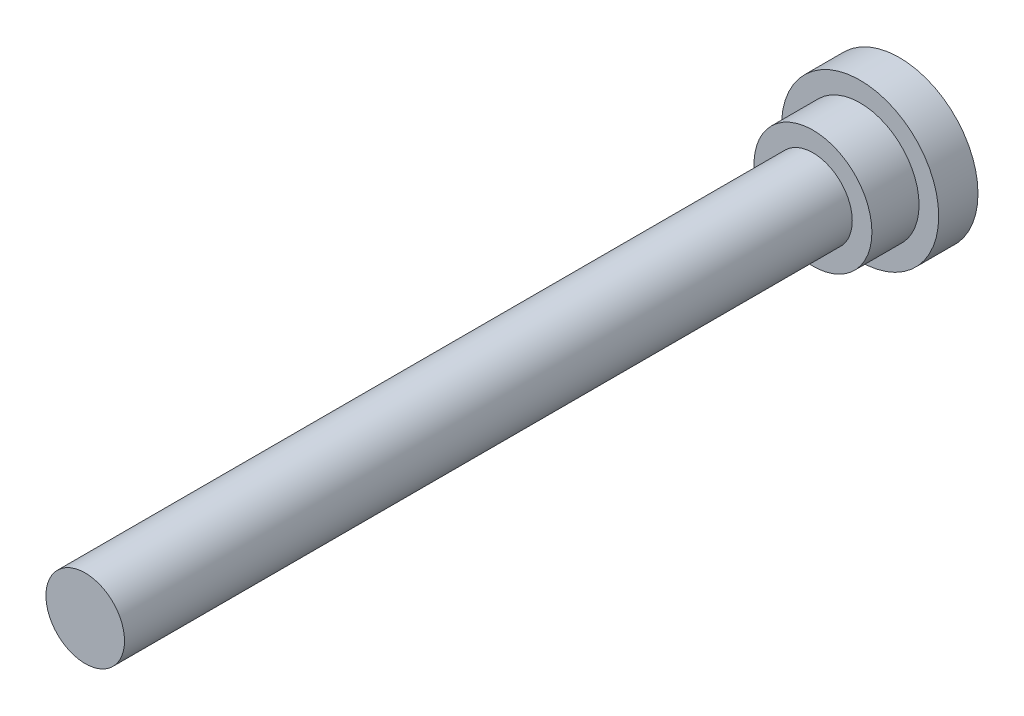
ISO-10303-21;
HEADER;
FILE_DESCRIPTION(('STEP AP214'),'2;1');
FILE_NAME('part.step','',(''),(''),'','','');
FILE_SCHEMA(('AUTOMOTIVE_DESIGN { 1 0 10303 214 1 1 1 1 }'));
ENDSEC;
DATA;
#1=APPLICATION_CONTEXT('core data for automotive mechanical design processes');
#2=APPLICATION_PROTOCOL_DEFINITION('international standard','automotive_design',2000,#1);
#3=PRODUCT_CONTEXT('',#1,'mechanical');
#4=PRODUCT('Part','Part','',(#3));
#5=PRODUCT_RELATED_PRODUCT_CATEGORY('part','',(#4));
#6=PRODUCT_DEFINITION_FORMATION('','',#4);
#7=PRODUCT_DEFINITION_CONTEXT('part definition',#1,'design');
#8=PRODUCT_DEFINITION('design','',#6,#7);
#9=PRODUCT_DEFINITION_SHAPE('','',#8);
#10=(LENGTH_UNIT() NAMED_UNIT(*) SI_UNIT(.MILLI.,.METRE.));
#11=(NAMED_UNIT(*) PLANE_ANGLE_UNIT() SI_UNIT($,.RADIAN.));
#12=(NAMED_UNIT(*) SI_UNIT($,.STERADIAN.) SOLID_ANGLE_UNIT());
#13=UNCERTAINTY_MEASURE_WITH_UNIT(LENGTH_MEASURE(1.E-05),#10,'distance_accuracy_value','');
#14=(GEOMETRIC_REPRESENTATION_CONTEXT(3) GLOBAL_UNCERTAINTY_ASSIGNED_CONTEXT((#13)) GLOBAL_UNIT_ASSIGNED_CONTEXT((#10,
#11,#12)) REPRESENTATION_CONTEXT('',''));
#15=CARTESIAN_POINT('',(0.,0.,0.));
#16=DIRECTION('',(0.,0.,1.));
#17=DIRECTION('',(1.,0.,0.));
#18=AXIS2_PLACEMENT_3D('',#15,#16,#17);
#19=CARTESIAN_POINT('',(0.,0.,103.6));
#20=DIRECTION('',(0.,0.,1.));
#21=DIRECTION('',(1.,0.,0.));
#22=AXIS2_PLACEMENT_3D('',#19,#20,#21);
#23=PLANE('',#22);
#24=CARTESIAN_POINT('',(0.,0.,103.6));
#25=DIRECTION('',(0.,0.,1.));
#26=DIRECTION('',(1.,0.,0.));
#27=AXIS2_PLACEMENT_3D('',#24,#25,#26);
#28=CIRCLE('',#27,5.);
#29=CARTESIAN_POINT('',(5.,0.,103.6));
#30=VERTEX_POINT('',#29);
#31=EDGE_CURVE('E8',#30,#30,#28,.T.);
#32=ORIENTED_EDGE('',*,*,#31,.T.);
#33=EDGE_LOOP('',(#32));
#34=FACE_BOUND('',#33,.T.);
#35=ADVANCED_FACE('F12',(#34),#23,.T.);
#36=CARTESIAN_POINT('',(0.,0.,30.));
#37=DIRECTION('',(0.,0.,1.));
#38=DIRECTION('',(1.,0.,0.));
#39=AXIS2_PLACEMENT_3D('',#36,#37,#38);
#40=CYLINDRICAL_SURFACE('',#39,5.);
#41=CARTESIAN_POINT('',(0.,0.,11.));
#42=DIRECTION('',(0.,0.,1.));
#43=DIRECTION('',(1.,0.,0.));
#44=AXIS2_PLACEMENT_3D('',#41,#42,#43);
#45=CIRCLE('',#44,5.);
#46=CARTESIAN_POINT('',(5.,0.,11.));
#47=VERTEX_POINT('',#46);
#48=EDGE_CURVE('E18',#47,#47,#45,.T.);
#49=ORIENTED_EDGE('',*,*,#48,.T.);
#50=EDGE_LOOP('',(#49));
#51=FACE_BOUND('',#50,.T.);
#52=ORIENTED_EDGE('',*,*,#31,.F.);
#53=EDGE_LOOP('',(#52));
#54=FACE_BOUND('',#53,.T.);
#55=ADVANCED_FACE('F52',(#51,#54),#40,.T.);
#56=CARTESIAN_POINT('',(-5.,0.,11.));
#57=DIRECTION('',(0.,0.,1.));
#58=DIRECTION('',(1.,0.,0.));
#59=AXIS2_PLACEMENT_3D('',#56,#57,#58);
#60=PLANE('',#59);
#61=CARTESIAN_POINT('',(0.,0.,11.));
#62=DIRECTION('',(0.,0.,1.));
#63=DIRECTION('',(1.,0.,0.));
#64=AXIS2_PLACEMENT_3D('',#61,#62,#63);
#65=CIRCLE('',#64,7.5);
#66=CARTESIAN_POINT('',(7.5,0.,11.));
#67=VERTEX_POINT('',#66);
#68=EDGE_CURVE('E22',#67,#67,#65,.T.);
#69=ORIENTED_EDGE('',*,*,#68,.T.);
#70=EDGE_LOOP('',(#69));
#71=FACE_BOUND('',#70,.T.);
#72=ORIENTED_EDGE('',*,*,#48,.F.);
#73=EDGE_LOOP('',(#72));
#74=FACE_BOUND('',#73,.T.);
#75=ADVANCED_FACE('F57',(#71,#74),#60,.T.);
#76=CARTESIAN_POINT('',(0.,0.,30.));
#77=DIRECTION('',(0.,0.,1.));
#78=DIRECTION('',(1.,0.,0.));
#79=AXIS2_PLACEMENT_3D('',#76,#77,#78);
#80=CYLINDRICAL_SURFACE('',#79,7.5);
#81=CARTESIAN_POINT('',(0.,0.,5.));
#82=DIRECTION('',(0.,0.,1.));
#83=DIRECTION('',(1.,0.,0.));
#84=AXIS2_PLACEMENT_3D('',#81,#82,#83);
#85=CIRCLE('',#84,7.5);
#86=CARTESIAN_POINT('',(7.5,0.,5.));
#87=VERTEX_POINT('',#86);
#88=EDGE_CURVE('E26',#87,#87,#85,.T.);
#89=ORIENTED_EDGE('',*,*,#88,.T.);
#90=EDGE_LOOP('',(#89));
#91=FACE_BOUND('',#90,.T.);
#92=ORIENTED_EDGE('',*,*,#68,.F.);
#93=EDGE_LOOP('',(#92));
#94=FACE_BOUND('',#93,.T.);
#95=ADVANCED_FACE('F62',(#91,#94),#80,.T.);
#96=CARTESIAN_POINT('',(-7.5,0.,5.));
#97=DIRECTION('',(0.,0.,1.));
#98=DIRECTION('',(1.,0.,0.));
#99=AXIS2_PLACEMENT_3D('',#96,#97,#98);
#100=PLANE('',#99);
#101=CARTESIAN_POINT('',(0.,0.,5.));
#102=DIRECTION('',(0.,0.,1.));
#103=DIRECTION('',(1.,0.,0.));
#104=AXIS2_PLACEMENT_3D('',#101,#102,#103);
#105=CIRCLE('',#104,10.);
#106=CARTESIAN_POINT('',(10.,0.,5.));
#107=VERTEX_POINT('',#106);
#108=EDGE_CURVE('E31',#107,#107,#105,.T.);
#109=ORIENTED_EDGE('',*,*,#108,.T.);
#110=EDGE_LOOP('',(#109));
#111=FACE_BOUND('',#110,.T.);
#112=ORIENTED_EDGE('',*,*,#88,.F.);
#113=EDGE_LOOP('',(#112));
#114=FACE_BOUND('',#113,.T.);
#115=ADVANCED_FACE('F49',(#111,#114),#100,.T.);
#116=CARTESIAN_POINT('',(0.,0.,30.));
#117=DIRECTION('',(0.,0.,1.));
#118=DIRECTION('',(1.,0.,0.));
#119=AXIS2_PLACEMENT_3D('',#116,#117,#118);
#120=CYLINDRICAL_SURFACE('',#119,10.);
#121=CARTESIAN_POINT('',(0.,0.,0.));
#122=DIRECTION('',(0.,0.,1.));
#123=DIRECTION('',(1.,0.,0.));
#124=AXIS2_PLACEMENT_3D('',#121,#122,#123);
#125=CIRCLE('',#124,10.);
#126=CARTESIAN_POINT('',(10.,0.,0.));
#127=VERTEX_POINT('',#126);
#128=EDGE_CURVE('E34',#127,#127,#125,.T.);
#129=ORIENTED_EDGE('',*,*,#128,.T.);
#130=EDGE_LOOP('',(#129));
#131=FACE_BOUND('',#130,.T.);
#132=ORIENTED_EDGE('',*,*,#108,.F.);
#133=EDGE_LOOP('',(#132));
#134=FACE_BOUND('',#133,.T.);
#135=ADVANCED_FACE('F38',(#131,#134),#120,.T.);
#136=CARTESIAN_POINT('',(-10.,0.,0.));
#137=DIRECTION('',(0.,0.,-1.));
#138=DIRECTION('',(-1.,0.,0.));
#139=AXIS2_PLACEMENT_3D('',#136,#137,#138);
#140=PLANE('',#139);
#141=ORIENTED_EDGE('',*,*,#128,.F.);
#142=EDGE_LOOP('',(#141));
#143=FACE_BOUND('',#142,.T.);
#144=ADVANCED_FACE('F41',(#143),#140,.T.);
#145=CLOSED_SHELL('',(#35,#55,#75,#95,#115,#135,#144));
#146=MANIFOLD_SOLID_BREP('B1',#145);
#147=ADVANCED_BREP_SHAPE_REPRESENTATION('',(#18,#146),#14);
#148=SHAPE_DEFINITION_REPRESENTATION(#9,#147);
ENDSEC;
END-ISO-10303-21;
